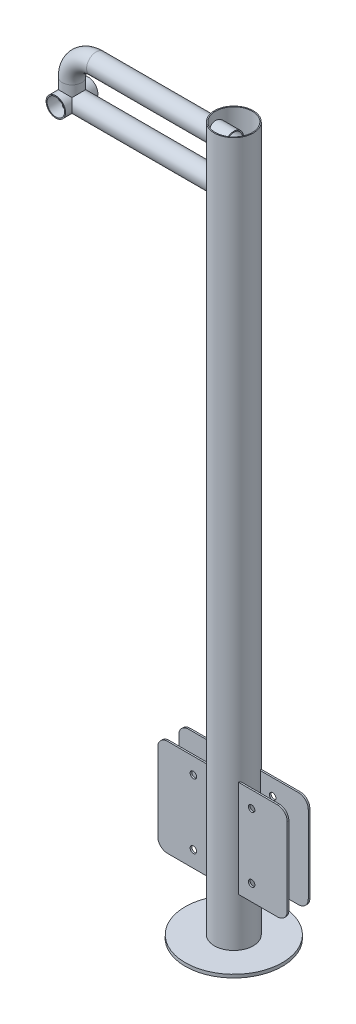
from build123d import *

# Parameters (mm, degrees)
ESQUISSE1_R               = 150
BOSS_EXTRU_1_DEPTH        = 10
ESQUISSE2_R               = 60
ESQUISSE2_R_2             = 57
BOSS_EXTRU_2_DEPTH        = 2175
BOSS_EXTRU_3_DEPTH        = 150
CONG_1_R                  = 30
CONG_1_OF_SYM_TRIE1_R     = 30
ESQUISSE4_R               = 10
ENL_V_MAT_EXTRU_1_DEPTH   = 2202.919617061
SYM_TRIE3_COPY_1_SKETCH_R = 10
SYM_TRIE3_COPY_1_DEPTH    = 2202.919617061
ESQUISSE5_R               = 30
ESQUISSE5_R_2             = 27
BOSS_EXTRU_4_DEPTH        = 50
ESQUISSE7_R               = 30
ESQUISSE7_R_2             = 27
ESQUISSE8_R               = 30
ESQUISSE8_R_2             = 27


with BuildPart() as part:
    # Esquisse1 → Boss.-Extru.1 (new body)
    with BuildSketch(Plane(origin=(0, 0, 0), x_dir=(1, 0, 0), z_dir=(0, 1, 0))):
        with Locations(Location((0, 0, 0), (0, 0, 270))):
            Circle(ESQUISSE1_R)
    extrude(amount=BOSS_EXTRU_1_DEPTH)

    # Esquisse2 → Boss.-Extru.2 (add)
    with BuildSketch(Plane(origin=(0, 10, 0), x_dir=(1, 0, 0), z_dir=(0, 1, 0))):
        with Locations(Location((0, 0, 0), (0, 0, 270))):
            Circle(ESQUISSE2_R)
        with Locations(Location((0, 0, 0), (0, 0, 270))):
            Circle(ESQUISSE2_R_2, mode=Mode.SUBTRACT)
    extrude(amount=BOSS_EXTRU_2_DEPTH)

    # Esquisse3 → Boss.-Extru.3 (add, symmetric)
    with BuildSketch(Plane(origin=(0, 310, 0), x_dir=(-1, 0, 0), z_dir=(0, 1, 0))):
        with BuildLine():
            Line((-51.961524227, -30), (-200, -30))
            Line((-200, -30), (-200, -35))
            Line((-200, -35), (-48.733971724, -35))
            ThreePointArc((-48.733971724, -35), (-50.409778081, -32.540041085), (-51.961524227, -30))
        make_face()
        with BuildLine():
            Line((200, -35), (48.733971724, -35))
            ThreePointArc((48.733971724, -35), (50.409778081, -32.540041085), (51.961524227, -30))
            Line((51.961524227, -30), (200, -30))
            Line((200, -30), (200, -35))
        make_face()
    boss_extru_3 = extrude(amount=BOSS_EXTRU_3_DEPTH, both=True)

    # Cong_1
    cong_1_edges = [part.edges().sort_by_distance(p)[0] for p in [
        (-200, 160, -32.5),
        (-200, 460, -32.5),
        (200, 160, -32.5),
        (200, 460, -32.5),
    ]]
    fillet(cong_1_edges, radius=CONG_1_R)

    # Sym_trie1: Boss.-Extru.3 across plane
    add(boss_extru_3.mirror(Plane.XY))

    # Cong_1 of Sym_trie1
    cong_1_of_sym_trie1_edges = [part.edges().sort_by_distance(p)[0] for p in [
        (-200, 160, 32.5),
        (-200, 460, 32.5),
        (200, 160, 32.5),
        (200, 460, 32.5),
    ]]
    fillet(cong_1_of_sym_trie1_edges, radius=CONG_1_OF_SYM_TRIE1_R)

    # Esquisse4 → Enl_v. mat.-Extru.1 (cut, through all)
    with BuildSketch(Plane(origin=(0, 0, -35), x_dir=(-1, 0, 0), z_dir=(0, 0, -1))):
        with Locations((-90, 410)):
            Circle(ESQUISSE4_R)
    enl_v_mat_extru_1 = extrude(amount=-ENL_V_MAT_EXTRU_1_DEPTH, mode=Mode.SUBTRACT)

    # Sym_trie2: Enl_v. mat.-Extru.1 across plane
    add(enl_v_mat_extru_1.mirror(Plane.ZX.offset(310)), mode=Mode.SUBTRACT)

    # Sym_trie3: Enl_v. mat.-Extru.1 across plane
    add(enl_v_mat_extru_1.mirror(Plane(origin=(0, 0, 0), x_dir=(0, 0, 1), z_dir=(1, 0, 0))), mode=Mode.SUBTRACT)

    # Sym_trie3 copy 1 sketch → Sym_trie3 copy 1 (cut, through all)
    with BuildSketch(Plane(origin=(0, 620, -35), x_dir=(1, 0, 0), z_dir=(0, 0, -1))):
        with Locations((-90, 410)):
            Circle(SYM_TRIE3_COPY_1_SKETCH_R)
    extrude(amount=-SYM_TRIE3_COPY_1_DEPTH, mode=Mode.SUBTRACT)



with BuildPart() as body_2:
    # Esquisse5 → Boss.-Extru.4 (new, symmetric)
    with BuildSketch(Plane.XY):
        with Locations((-500, 2000)):
            Circle(ESQUISSE5_R)
        with Locations((-500, 2000)):
            Circle(ESQUISSE5_R_2, mode=Mode.SUBTRACT)
    extrude(amount=BOSS_EXTRU_4_DEPTH, both=True)


with BuildPart() as part_1:
    add(part.part)

    add(body_2.part)  # Balayage2 merges body 2
    # Balayage2: sweep along a path in Esquisse6
    with BuildLine(Plane.XY) as balayage2_path:
        Line((0, 2130), (-425, 2130))
        ThreePointArc((-425, 2130), (-478.033008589, 2108.033008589), (-500, 2055))
        Line((-500, 2055), (-500, 2000))
    # Esquisse7 → Balayage2 (sweep)
    with BuildSketch(Plane(origin=(0, 0, 0), x_dir=(0, 0, -1), z_dir=(1, 0, 0))):
        with Locations((0, 2130)):
            Circle(ESQUISSE7_R)
        with Locations((0, 2130)):
            Circle(ESQUISSE7_R_2, mode=Mode.SUBTRACT)
    sweep(path=balayage2_path.line)

    # Balayage3: sweep along a path in Esquisse9
    with BuildLine(Plane.XY) as balayage3_path:
        Line((0, 2000), (-500, 2000))
    # Esquisse8 → Balayage3 (sweep)
    with BuildSketch(Plane(origin=(0, 0, 0), x_dir=(0, 0, -1), z_dir=(1, 0, 0))):
        with Locations((0, 2000)):
            Circle(ESQUISSE8_R)
        with Locations((0, 2000)):
            Circle(ESQUISSE8_R_2, mode=Mode.SUBTRACT)
    sweep(path=balayage3_path.line)


solid = part_1.part
